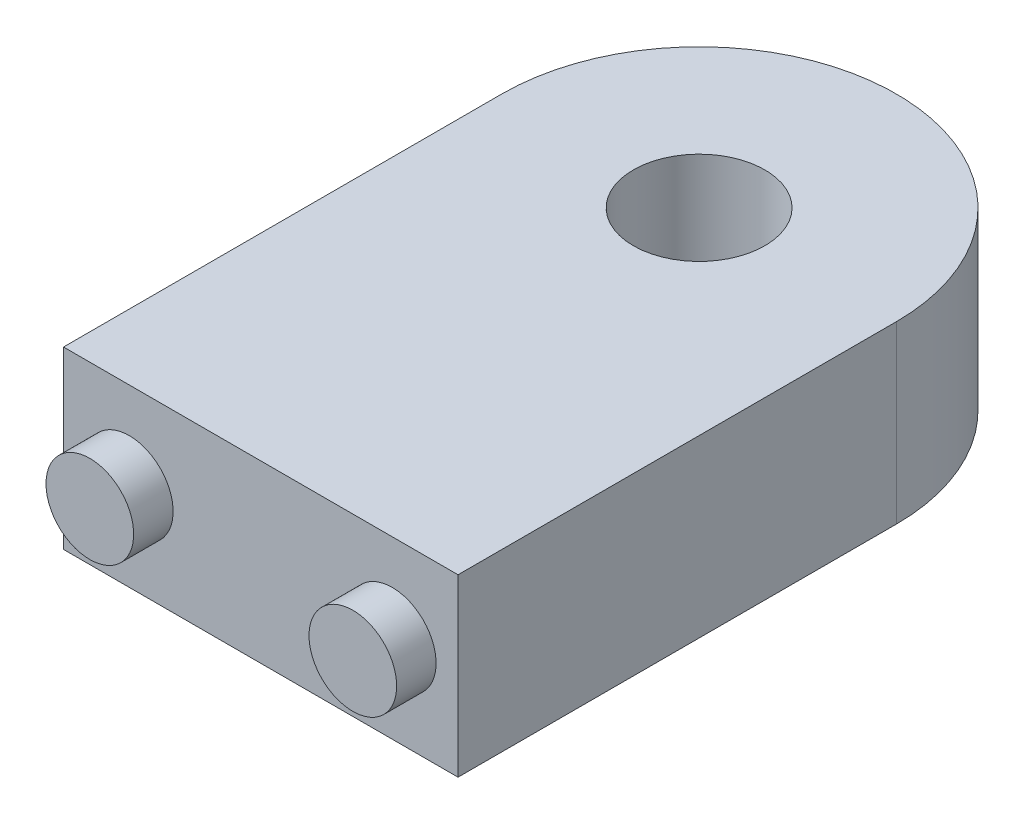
ISO-10303-21;
HEADER;
FILE_DESCRIPTION(('STEP AP214'),'2;1');
FILE_NAME('part.step','',(''),(''),'','','');
FILE_SCHEMA(('AUTOMOTIVE_DESIGN { 1 0 10303 214 1 1 1 1 }'));
ENDSEC;
DATA;
#1=APPLICATION_CONTEXT('core data for automotive mechanical design processes');
#2=APPLICATION_PROTOCOL_DEFINITION('international standard','automotive_design',2000,#1);
#3=PRODUCT_CONTEXT('',#1,'mechanical');
#4=PRODUCT('Part','Part','',(#3));
#5=PRODUCT_RELATED_PRODUCT_CATEGORY('part','',(#4));
#6=PRODUCT_DEFINITION_FORMATION('','',#4);
#7=PRODUCT_DEFINITION_CONTEXT('part definition',#1,'design');
#8=PRODUCT_DEFINITION('design','',#6,#7);
#9=PRODUCT_DEFINITION_SHAPE('','',#8);
#10=(LENGTH_UNIT() NAMED_UNIT(*) SI_UNIT(.MILLI.,.METRE.));
#11=(NAMED_UNIT(*) PLANE_ANGLE_UNIT() SI_UNIT($,.RADIAN.));
#12=(NAMED_UNIT(*) SI_UNIT($,.STERADIAN.) SOLID_ANGLE_UNIT());
#13=UNCERTAINTY_MEASURE_WITH_UNIT(LENGTH_MEASURE(1.E-05),#10,'distance_accuracy_value','');
#14=(GEOMETRIC_REPRESENTATION_CONTEXT(3) GLOBAL_UNCERTAINTY_ASSIGNED_CONTEXT((#13)) GLOBAL_UNIT_ASSIGNED_CONTEXT((#10,
#11,#12)) REPRESENTATION_CONTEXT('',''));
#15=CARTESIAN_POINT('',(0.,0.,0.));
#16=DIRECTION('',(0.,0.,1.));
#17=DIRECTION('',(1.,0.,0.));
#18=AXIS2_PLACEMENT_3D('',#15,#16,#17);
#19=CARTESIAN_POINT('',(0.,200.,-250.));
#20=DIRECTION('',(0.,-1.,0.));
#21=DIRECTION('',(0.,0.,-1.));
#22=AXIS2_PLACEMENT_3D('',#19,#20,#21);
#23=CYLINDRICAL_SURFACE('',#22,225.);
#24=CARTESIAN_POINT('',(0.,0.,-250.));
#25=DIRECTION('',(0.,1.,0.));
#26=DIRECTION('',(0.,0.,1.));
#27=AXIS2_PLACEMENT_3D('',#24,#25,#26);
#28=CIRCLE('',#27,225.);
#29=CARTESIAN_POINT('',(-225.,0.,-250.));
#30=VERTEX_POINT('',#29);
#31=CARTESIAN_POINT('',(225.,0.,-250.));
#32=VERTEX_POINT('',#31);
#33=EDGE_CURVE('E106',#30,#32,#28,.F.);
#34=ORIENTED_EDGE('',*,*,#33,.F.);
#35=DIRECTION('',(0.,-1.,0.));
#36=VECTOR('',#35,1.);
#37=CARTESIAN_POINT('',(-225.,200.,-250.));
#38=LINE('',#37,#36);
#39=CARTESIAN_POINT('',(-225.,200.,-250.));
#40=VERTEX_POINT('',#39);
#41=EDGE_CURVE('E81',#40,#30,#38,.T.);
#42=ORIENTED_EDGE('',*,*,#41,.F.);
#43=CARTESIAN_POINT('',(0.,200.,-250.));
#44=DIRECTION('',(0.,1.,0.));
#45=DIRECTION('',(0.,0.,1.));
#46=AXIS2_PLACEMENT_3D('',#43,#44,#45);
#47=CIRCLE('',#46,225.);
#48=CARTESIAN_POINT('',(225.,200.,-250.));
#49=VERTEX_POINT('',#48);
#50=EDGE_CURVE('E99',#40,#49,#47,.F.);
#51=ORIENTED_EDGE('',*,*,#50,.T.);
#52=DIRECTION('',(0.,-1.,0.));
#53=VECTOR('',#52,1.);
#54=CARTESIAN_POINT('',(225.,200.,-250.));
#55=LINE('',#54,#53);
#56=EDGE_CURVE('E77',#49,#32,#55,.T.);
#57=ORIENTED_EDGE('',*,*,#56,.T.);
#58=EDGE_LOOP('',(#34,#42,#51,#57));
#59=FACE_BOUND('',#58,.T.);
#60=ADVANCED_FACE('F38',(#59),#23,.T.);
#61=CARTESIAN_POINT('',(-225.,200.,0.));
#62=DIRECTION('',(-1.,0.,0.));
#63=DIRECTION('',(0.,0.,1.));
#64=AXIS2_PLACEMENT_3D('',#61,#62,#63);
#65=PLANE('',#64);
#66=DIRECTION('',(0.,0.,-1.));
#67=VECTOR('',#66,1.);
#68=CARTESIAN_POINT('',(-225.,0.,0.));
#69=LINE('',#68,#67);
#70=CARTESIAN_POINT('',(-225.,0.,250.));
#71=VERTEX_POINT('',#70);
#72=EDGE_CURVE('E92',#71,#30,#69,.T.);
#73=ORIENTED_EDGE('',*,*,#72,.F.);
#74=DIRECTION('',(0.,-1.,0.));
#75=VECTOR('',#74,1.);
#76=CARTESIAN_POINT('',(-225.,200.,250.));
#77=LINE('',#76,#75);
#78=CARTESIAN_POINT('',(-225.,200.,250.));
#79=VERTEX_POINT('',#78);
#80=EDGE_CURVE('E86',#79,#71,#77,.T.);
#81=ORIENTED_EDGE('',*,*,#80,.F.);
#82=DIRECTION('',(0.,0.,-1.));
#83=VECTOR('',#82,1.);
#84=CARTESIAN_POINT('',(-225.,200.,0.));
#85=LINE('',#84,#83);
#86=EDGE_CURVE('E90',#79,#40,#85,.T.);
#87=ORIENTED_EDGE('',*,*,#86,.T.);
#88=ORIENTED_EDGE('',*,*,#41,.T.);
#89=EDGE_LOOP('',(#73,#81,#87,#88));
#90=FACE_BOUND('',#89,.T.);
#91=ADVANCED_FACE('F88',(#90),#65,.T.);
#92=CARTESIAN_POINT('',(0.,200.,250.));
#93=DIRECTION('',(0.,0.,-1.));
#94=DIRECTION('',(-1.,0.,0.));
#95=AXIS2_PLACEMENT_3D('',#92,#93,#94);
#96=PLANE('',#95);
#97=CARTESIAN_POINT('',(-150.,100.,250.));
#98=DIRECTION('',(0.,0.,-1.));
#99=DIRECTION('',(-1.,0.,0.));
#100=AXIS2_PLACEMENT_3D('',#97,#98,#99);
#101=CIRCLE('',#100,50.);
#102=CARTESIAN_POINT('',(-200.,100.,250.));
#103=VERTEX_POINT('',#102);
#104=EDGE_CURVE('E11',#103,#103,#101,.F.);
#105=ORIENTED_EDGE('',*,*,#104,.F.);
#106=EDGE_LOOP('',(#105));
#107=FACE_BOUND('',#106,.T.);
#108=CARTESIAN_POINT('',(150.,100.,250.));
#109=DIRECTION('',(0.,0.,-1.));
#110=DIRECTION('',(-1.,0.,0.));
#111=AXIS2_PLACEMENT_3D('',#108,#109,#110);
#112=CIRCLE('',#111,50.);
#113=CARTESIAN_POINT('',(100.,100.,250.));
#114=VERTEX_POINT('',#113);
#115=EDGE_CURVE('E46',#114,#114,#112,.F.);
#116=ORIENTED_EDGE('',*,*,#115,.F.);
#117=EDGE_LOOP('',(#116));
#118=FACE_BOUND('',#117,.T.);
#119=DIRECTION('',(1.,0.,0.));
#120=VECTOR('',#119,1.);
#121=CARTESIAN_POINT('',(0.,0.,250.));
#122=LINE('',#121,#120);
#123=CARTESIAN_POINT('',(225.,0.,250.));
#124=VERTEX_POINT('',#123);
#125=EDGE_CURVE('E70',#71,#124,#122,.T.);
#126=ORIENTED_EDGE('',*,*,#125,.T.);
#127=DIRECTION('',(0.,-1.,0.));
#128=VECTOR('',#127,1.);
#129=CARTESIAN_POINT('',(225.,200.,250.));
#130=LINE('',#129,#128);
#131=CARTESIAN_POINT('',(225.,200.,250.));
#132=VERTEX_POINT('',#131);
#133=EDGE_CURVE('E93',#132,#124,#130,.T.);
#134=ORIENTED_EDGE('',*,*,#133,.F.);
#135=DIRECTION('',(1.,0.,0.));
#136=VECTOR('',#135,1.);
#137=CARTESIAN_POINT('',(0.,200.,250.));
#138=LINE('',#137,#136);
#139=EDGE_CURVE('E95',#79,#132,#138,.T.);
#140=ORIENTED_EDGE('',*,*,#139,.F.);
#141=ORIENTED_EDGE('',*,*,#80,.T.);
#142=EDGE_LOOP('',(#126,#134,#140,#141));
#143=FACE_BOUND('',#142,.T.);
#144=ADVANCED_FACE('F96',(#107,#118,#143),#96,.F.);
#145=CARTESIAN_POINT('',(225.,200.,0.));
#146=DIRECTION('',(-1.,0.,0.));
#147=DIRECTION('',(0.,0.,1.));
#148=AXIS2_PLACEMENT_3D('',#145,#146,#147);
#149=PLANE('',#148);
#150=DIRECTION('',(0.,0.,-1.));
#151=VECTOR('',#150,1.);
#152=CARTESIAN_POINT('',(225.,0.,0.));
#153=LINE('',#152,#151);
#154=EDGE_CURVE('E101',#124,#32,#153,.T.);
#155=ORIENTED_EDGE('',*,*,#154,.T.);
#156=ORIENTED_EDGE('',*,*,#56,.F.);
#157=DIRECTION('',(0.,0.,-1.));
#158=VECTOR('',#157,1.);
#159=CARTESIAN_POINT('',(225.,200.,0.));
#160=LINE('',#159,#158);
#161=EDGE_CURVE('E54',#132,#49,#160,.T.);
#162=ORIENTED_EDGE('',*,*,#161,.F.);
#163=ORIENTED_EDGE('',*,*,#133,.T.);
#164=EDGE_LOOP('',(#155,#156,#162,#163));
#165=FACE_BOUND('',#164,.T.);
#166=ADVANCED_FACE('F121',(#165),#149,.F.);
#167=CARTESIAN_POINT('',(0.,200.,0.));
#168=DIRECTION('',(0.,1.,0.));
#169=DIRECTION('',(0.,0.,1.));
#170=AXIS2_PLACEMENT_3D('',#167,#168,#169);
#171=PLANE('',#170);
#172=CARTESIAN_POINT('',(0.,200.,-250.));
#173=DIRECTION('',(0.,1.,0.));
#174=DIRECTION('',(0.,0.,1.));
#175=AXIS2_PLACEMENT_3D('',#172,#173,#174);
#176=CIRCLE('',#175,75.);
#177=CARTESIAN_POINT('',(0.,200.,-175.));
#178=VERTEX_POINT('',#177);
#179=EDGE_CURVE('E173',#178,#178,#176,.T.);
#180=ORIENTED_EDGE('',*,*,#179,.F.);
#181=EDGE_LOOP('',(#180));
#182=FACE_BOUND('',#181,.T.);
#183=ORIENTED_EDGE('',*,*,#50,.F.);
#184=ORIENTED_EDGE('',*,*,#86,.F.);
#185=ORIENTED_EDGE('',*,*,#139,.T.);
#186=ORIENTED_EDGE('',*,*,#161,.T.);
#187=EDGE_LOOP('',(#183,#184,#185,#186));
#188=FACE_BOUND('',#187,.T.);
#189=ADVANCED_FACE('F98',(#182,#188),#171,.T.);
#190=CARTESIAN_POINT('',(0.,0.,0.));
#191=DIRECTION('',(0.,1.,0.));
#192=DIRECTION('',(0.,0.,1.));
#193=AXIS2_PLACEMENT_3D('',#190,#191,#192);
#194=PLANE('',#193);
#195=CARTESIAN_POINT('',(0.,0.,-250.));
#196=DIRECTION('',(0.,1.,0.));
#197=DIRECTION('',(0.,0.,1.));
#198=AXIS2_PLACEMENT_3D('',#195,#196,#197);
#199=CIRCLE('',#198,75.);
#200=CARTESIAN_POINT('',(0.,0.,-175.));
#201=VERTEX_POINT('',#200);
#202=EDGE_CURVE('E109',#201,#201,#199,.T.);
#203=ORIENTED_EDGE('',*,*,#202,.T.);
#204=EDGE_LOOP('',(#203));
#205=FACE_BOUND('',#204,.T.);
#206=ORIENTED_EDGE('',*,*,#33,.T.);
#207=ORIENTED_EDGE('',*,*,#154,.F.);
#208=ORIENTED_EDGE('',*,*,#125,.F.);
#209=ORIENTED_EDGE('',*,*,#72,.T.);
#210=EDGE_LOOP('',(#206,#207,#208,#209));
#211=FACE_BOUND('',#210,.T.);
#212=ADVANCED_FACE('F136',(#205,#211),#194,.F.);
#213=CARTESIAN_POINT('',(0.,0.,-250.));
#214=DIRECTION('',(0.,1.,0.));
#215=DIRECTION('',(0.,0.,1.));
#216=AXIS2_PLACEMENT_3D('',#213,#214,#215);
#217=CYLINDRICAL_SURFACE('',#216,75.);
#218=ORIENTED_EDGE('',*,*,#202,.F.);
#219=EDGE_LOOP('',(#218));
#220=FACE_BOUND('',#219,.T.);
#221=ORIENTED_EDGE('',*,*,#179,.T.);
#222=EDGE_LOOP('',(#221));
#223=FACE_BOUND('',#222,.T.);
#224=ADVANCED_FACE('F138',(#220,#223),#217,.F.);
#225=CARTESIAN_POINT('',(150.,100.,295.));
#226=DIRECTION('',(0.,0.,-1.));
#227=DIRECTION('',(-1.,0.,0.));
#228=AXIS2_PLACEMENT_3D('',#225,#226,#227);
#229=CYLINDRICAL_SURFACE('',#228,50.);
#230=CARTESIAN_POINT('',(150.,100.,295.));
#231=DIRECTION('',(0.,0.,1.));
#232=DIRECTION('',(1.,0.,0.));
#233=AXIS2_PLACEMENT_3D('',#230,#231,#232);
#234=CIRCLE('',#233,50.);
#235=CARTESIAN_POINT('',(100.,100.,295.));
#236=VERTEX_POINT('',#235);
#237=EDGE_CURVE('E170',#236,#236,#234,.T.);
#238=CARTESIAN_POINT('',(100.,100.,295.));
#239=CARTESIAN_POINT('',(100.,100.,294.53125));
#240=CARTESIAN_POINT('',(100.,100.,294.0625));
#241=CARTESIAN_POINT('',(100.,100.,293.125));
#242=CARTESIAN_POINT('',(100.,100.,292.65625));
#243=CARTESIAN_POINT('',(100.,100.,291.71875));
#244=CARTESIAN_POINT('',(100.,100.,291.25));
#245=CARTESIAN_POINT('',(100.,100.,290.3125));
#246=CARTESIAN_POINT('',(100.,100.,289.84375));
#247=CARTESIAN_POINT('',(100.,100.,288.90625));
#248=CARTESIAN_POINT('',(100.,100.,288.4375));
#249=CARTESIAN_POINT('',(100.,100.,287.5));
#250=CARTESIAN_POINT('',(100.,100.,287.03125));
#251=CARTESIAN_POINT('',(100.,100.,286.09375));
#252=CARTESIAN_POINT('',(100.,100.,285.625));
#253=CARTESIAN_POINT('',(100.,100.,284.6875));
#254=CARTESIAN_POINT('',(100.,100.,284.21875));
#255=CARTESIAN_POINT('',(100.,100.,283.28125));
#256=CARTESIAN_POINT('',(100.,100.,282.8125));
#257=CARTESIAN_POINT('',(100.,100.,281.875));
#258=CARTESIAN_POINT('',(100.,100.,281.40625));
#259=CARTESIAN_POINT('',(100.,100.,280.46875));
#260=CARTESIAN_POINT('',(100.,100.,280.));
#261=CARTESIAN_POINT('',(100.,100.,279.0625));
#262=CARTESIAN_POINT('',(100.,100.,278.59375));
#263=CARTESIAN_POINT('',(100.,100.,277.65625));
#264=CARTESIAN_POINT('',(100.,100.,277.1875));
#265=CARTESIAN_POINT('',(100.,100.,276.25));
#266=CARTESIAN_POINT('',(100.,100.,275.78125));
#267=CARTESIAN_POINT('',(100.,100.,274.84375));
#268=CARTESIAN_POINT('',(100.,100.,274.375));
#269=CARTESIAN_POINT('',(100.,100.,273.4375));
#270=CARTESIAN_POINT('',(100.,100.,272.96875));
#271=CARTESIAN_POINT('',(100.,100.,272.03125));
#272=CARTESIAN_POINT('',(100.,100.,271.5625));
#273=CARTESIAN_POINT('',(100.,100.,270.625));
#274=CARTESIAN_POINT('',(100.,100.,270.15625));
#275=CARTESIAN_POINT('',(100.,100.,269.21875));
#276=CARTESIAN_POINT('',(100.,100.,268.75));
#277=CARTESIAN_POINT('',(100.,100.,267.8125));
#278=CARTESIAN_POINT('',(100.,100.,267.34375));
#279=CARTESIAN_POINT('',(100.,100.,266.40625));
#280=CARTESIAN_POINT('',(100.,100.,265.9375));
#281=CARTESIAN_POINT('',(100.,100.,265.));
#282=CARTESIAN_POINT('',(100.,100.,264.53125));
#283=CARTESIAN_POINT('',(100.,100.,263.59375));
#284=CARTESIAN_POINT('',(100.,100.,263.125));
#285=CARTESIAN_POINT('',(100.,100.,262.1875));
#286=CARTESIAN_POINT('',(100.,100.,261.71875));
#287=CARTESIAN_POINT('',(100.,100.,260.78125));
#288=CARTESIAN_POINT('',(100.,100.,260.3125));
#289=CARTESIAN_POINT('',(100.,100.,259.375));
#290=CARTESIAN_POINT('',(100.,100.,258.90625));
#291=CARTESIAN_POINT('',(100.,100.,257.96875));
#292=CARTESIAN_POINT('',(100.,100.,257.5));
#293=CARTESIAN_POINT('',(100.,100.,256.5625));
#294=CARTESIAN_POINT('',(100.,100.,256.09375));
#295=CARTESIAN_POINT('',(100.,100.,255.15625));
#296=CARTESIAN_POINT('',(100.,100.,254.6875));
#297=CARTESIAN_POINT('',(100.,100.,253.75));
#298=CARTESIAN_POINT('',(100.,100.,253.28125));
#299=CARTESIAN_POINT('',(100.,100.,252.34375));
#300=CARTESIAN_POINT('',(100.,100.,251.875));
#301=CARTESIAN_POINT('',(100.,100.,250.9375));
#302=CARTESIAN_POINT('',(100.,100.,250.46875));
#303=CARTESIAN_POINT('',(100.,100.,250.));
#304=B_SPLINE_CURVE_WITH_KNOTS('',3,(#238,#239,#240,#241,#242,#243,#244,#245,#246,#247,#248,
#249,#250,#251,#252,#253,#254,#255,#256,#257,#258,#259,#260,#261,#262,#263,#264,#265,#266,#267,
#268,#269,#270,#271,#272,#273,#274,#275,#276,#277,#278,#279,#280,#281,#282,#283,#284,#285,#286,
#287,#288,#289,#290,#291,#292,#293,#294,#295,#296,#297,#298,#299,#300,#301,#302,#303),
.UNSPECIFIED.,.F.,.F.,(4,2,2,2,2,2,2,2,2,2,2,2,2,2,2,2,2,2,2,2,2,2,2,2,2,2,2,2,2,2,2,2,4),(0.,
1.40625,2.8125,4.21874999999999,5.62499999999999,7.03124999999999,8.43749999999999,
9.84374999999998,11.25,12.65625,14.0625,15.46875,16.875,18.28125,19.6875,21.09375,22.5,23.90625,
25.3125,26.71875,28.125,29.53125,30.9375,32.34375,33.7499999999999,35.1562499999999,
36.5624999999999,37.9687499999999,39.3749999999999,40.7812499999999,42.1874999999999,
43.5937499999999,44.9999999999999),.UNSPECIFIED.);
#305=EDGE_CURVE('BSEAM118',#236,#114,#304,.T.);
#306=ORIENTED_EDGE('',*,*,#237,.F.);
#307=ORIENTED_EDGE('',*,*,#115,.T.);
#308=ORIENTED_EDGE('',*,*,#305,.T.);
#309=ORIENTED_EDGE('',*,*,#305,.F.);
#310=EDGE_LOOP('',(#306,#308,#307,#309));
#311=FACE_BOUND('',#310,.T.);
#312=ADVANCED_FACE('F118',(#311),#229,.T.);
#313=CARTESIAN_POINT('',(0.,0.,295.));
#314=DIRECTION('',(0.,0.,1.));
#315=DIRECTION('',(1.,0.,0.));
#316=AXIS2_PLACEMENT_3D('',#313,#314,#315);
#317=PLANE('',#316);
#318=ORIENTED_EDGE('',*,*,#237,.T.);
#319=EDGE_LOOP('',(#318));
#320=FACE_BOUND('',#319,.T.);
#321=ADVANCED_FACE('F153',(#320),#317,.T.);
#322=CARTESIAN_POINT('',(-150.,100.,295.));
#323=DIRECTION('',(0.,0.,-1.));
#324=DIRECTION('',(-1.,0.,0.));
#325=AXIS2_PLACEMENT_3D('',#322,#323,#324);
#326=CYLINDRICAL_SURFACE('',#325,50.);
#327=CARTESIAN_POINT('',(-150.,100.,295.));
#328=DIRECTION('',(0.,0.,1.));
#329=DIRECTION('',(1.,0.,0.));
#330=AXIS2_PLACEMENT_3D('',#327,#328,#329);
#331=CIRCLE('',#330,50.);
#332=CARTESIAN_POINT('',(-200.,100.,295.));
#333=VERTEX_POINT('',#332);
#334=EDGE_CURVE('E169',#333,#333,#331,.T.);
#335=CARTESIAN_POINT('',(-200.,100.,295.));
#336=CARTESIAN_POINT('',(-200.,100.,294.53125));
#337=CARTESIAN_POINT('',(-200.,100.,294.0625));
#338=CARTESIAN_POINT('',(-200.,100.,293.125));
#339=CARTESIAN_POINT('',(-200.,100.,292.65625));
#340=CARTESIAN_POINT('',(-200.,100.,291.71875));
#341=CARTESIAN_POINT('',(-200.,100.,291.25));
#342=CARTESIAN_POINT('',(-200.,100.,290.3125));
#343=CARTESIAN_POINT('',(-200.,100.,289.84375));
#344=CARTESIAN_POINT('',(-200.,100.,288.90625));
#345=CARTESIAN_POINT('',(-200.,100.,288.4375));
#346=CARTESIAN_POINT('',(-200.,100.,287.5));
#347=CARTESIAN_POINT('',(-200.,100.,287.03125));
#348=CARTESIAN_POINT('',(-200.,100.,286.09375));
#349=CARTESIAN_POINT('',(-200.,100.,285.625));
#350=CARTESIAN_POINT('',(-200.,100.,284.6875));
#351=CARTESIAN_POINT('',(-200.,100.,284.21875));
#352=CARTESIAN_POINT('',(-200.,100.,283.28125));
#353=CARTESIAN_POINT('',(-200.,100.,282.8125));
#354=CARTESIAN_POINT('',(-200.,100.,281.875));
#355=CARTESIAN_POINT('',(-200.,100.,281.40625));
#356=CARTESIAN_POINT('',(-200.,100.,280.46875));
#357=CARTESIAN_POINT('',(-200.,100.,280.));
#358=CARTESIAN_POINT('',(-200.,100.,279.0625));
#359=CARTESIAN_POINT('',(-200.,100.,278.59375));
#360=CARTESIAN_POINT('',(-200.,100.,277.65625));
#361=CARTESIAN_POINT('',(-200.,100.,277.1875));
#362=CARTESIAN_POINT('',(-200.,100.,276.25));
#363=CARTESIAN_POINT('',(-200.,100.,275.78125));
#364=CARTESIAN_POINT('',(-200.,100.,274.84375));
#365=CARTESIAN_POINT('',(-200.,100.,274.375));
#366=CARTESIAN_POINT('',(-200.,100.,273.4375));
#367=CARTESIAN_POINT('',(-200.,100.,272.96875));
#368=CARTESIAN_POINT('',(-200.,100.,272.03125));
#369=CARTESIAN_POINT('',(-200.,100.,271.5625));
#370=CARTESIAN_POINT('',(-200.,100.,270.625));
#371=CARTESIAN_POINT('',(-200.,100.,270.15625));
#372=CARTESIAN_POINT('',(-200.,100.,269.21875));
#373=CARTESIAN_POINT('',(-200.,100.,268.75));
#374=CARTESIAN_POINT('',(-200.,100.,267.8125));
#375=CARTESIAN_POINT('',(-200.,100.,267.34375));
#376=CARTESIAN_POINT('',(-200.,100.,266.40625));
#377=CARTESIAN_POINT('',(-200.,100.,265.9375));
#378=CARTESIAN_POINT('',(-200.,100.,265.));
#379=CARTESIAN_POINT('',(-200.,100.,264.53125));
#380=CARTESIAN_POINT('',(-200.,100.,263.59375));
#381=CARTESIAN_POINT('',(-200.,100.,263.125));
#382=CARTESIAN_POINT('',(-200.,100.,262.1875));
#383=CARTESIAN_POINT('',(-200.,100.,261.71875));
#384=CARTESIAN_POINT('',(-200.,100.,260.78125));
#385=CARTESIAN_POINT('',(-200.,100.,260.3125));
#386=CARTESIAN_POINT('',(-200.,100.,259.375));
#387=CARTESIAN_POINT('',(-200.,100.,258.90625));
#388=CARTESIAN_POINT('',(-200.,100.,257.96875));
#389=CARTESIAN_POINT('',(-200.,100.,257.5));
#390=CARTESIAN_POINT('',(-200.,100.,256.5625));
#391=CARTESIAN_POINT('',(-200.,100.,256.09375));
#392=CARTESIAN_POINT('',(-200.,100.,255.15625));
#393=CARTESIAN_POINT('',(-200.,100.,254.6875));
#394=CARTESIAN_POINT('',(-200.,100.,253.75));
#395=CARTESIAN_POINT('',(-200.,100.,253.28125));
#396=CARTESIAN_POINT('',(-200.,100.,252.34375));
#397=CARTESIAN_POINT('',(-200.,100.,251.875));
#398=CARTESIAN_POINT('',(-200.,100.,250.9375));
#399=CARTESIAN_POINT('',(-200.,100.,250.46875));
#400=CARTESIAN_POINT('',(-200.,100.,250.));
#401=B_SPLINE_CURVE_WITH_KNOTS('',3,(#335,#336,#337,#338,#339,#340,#341,#342,#343,#344,#345,
#346,#347,#348,#349,#350,#351,#352,#353,#354,#355,#356,#357,#358,#359,#360,#361,#362,#363,#364,
#365,#366,#367,#368,#369,#370,#371,#372,#373,#374,#375,#376,#377,#378,#379,#380,#381,#382,#383,
#384,#385,#386,#387,#388,#389,#390,#391,#392,#393,#394,#395,#396,#397,#398,#399,#400),
.UNSPECIFIED.,.F.,.F.,(4,2,2,2,2,2,2,2,2,2,2,2,2,2,2,2,2,2,2,2,2,2,2,2,2,2,2,2,2,2,2,2,4),(0.,
1.40625,2.8125,4.21874999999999,5.62499999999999,7.03124999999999,8.43749999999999,
9.84374999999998,11.25,12.65625,14.0625,15.46875,16.875,18.28125,19.6875,21.09375,22.5,23.90625,
25.3125,26.71875,28.125,29.53125,30.9375,32.34375,33.7499999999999,35.1562499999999,
36.5624999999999,37.9687499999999,39.3749999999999,40.7812499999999,42.1874999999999,
43.5937499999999,44.9999999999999),.UNSPECIFIED.);
#402=EDGE_CURVE('BSEAM157',#333,#103,#401,.T.);
#403=ORIENTED_EDGE('',*,*,#334,.F.);
#404=ORIENTED_EDGE('',*,*,#104,.T.);
#405=ORIENTED_EDGE('',*,*,#402,.T.);
#406=ORIENTED_EDGE('',*,*,#402,.F.);
#407=EDGE_LOOP('',(#403,#405,#404,#406));
#408=FACE_BOUND('',#407,.T.);
#409=ADVANCED_FACE('F157',(#408),#326,.T.);
#410=CARTESIAN_POINT('',(0.,0.,295.));
#411=DIRECTION('',(0.,0.,1.));
#412=DIRECTION('',(1.,0.,0.));
#413=AXIS2_PLACEMENT_3D('',#410,#411,#412);
#414=PLANE('',#413);
#415=ORIENTED_EDGE('',*,*,#334,.T.);
#416=EDGE_LOOP('',(#415));
#417=FACE_BOUND('',#416,.T.);
#418=ADVANCED_FACE('F161',(#417),#414,.T.);
#419=CLOSED_SHELL('',(#60,#91,#144,#166,#189,#212,#224,#312,#321,#409,#418));
#420=MANIFOLD_SOLID_BREP('B2',#419);
#421=ADVANCED_BREP_SHAPE_REPRESENTATION('',(#18,#420),#14);
#422=SHAPE_DEFINITION_REPRESENTATION(#9,#421);
ENDSEC;
END-ISO-10303-21;
